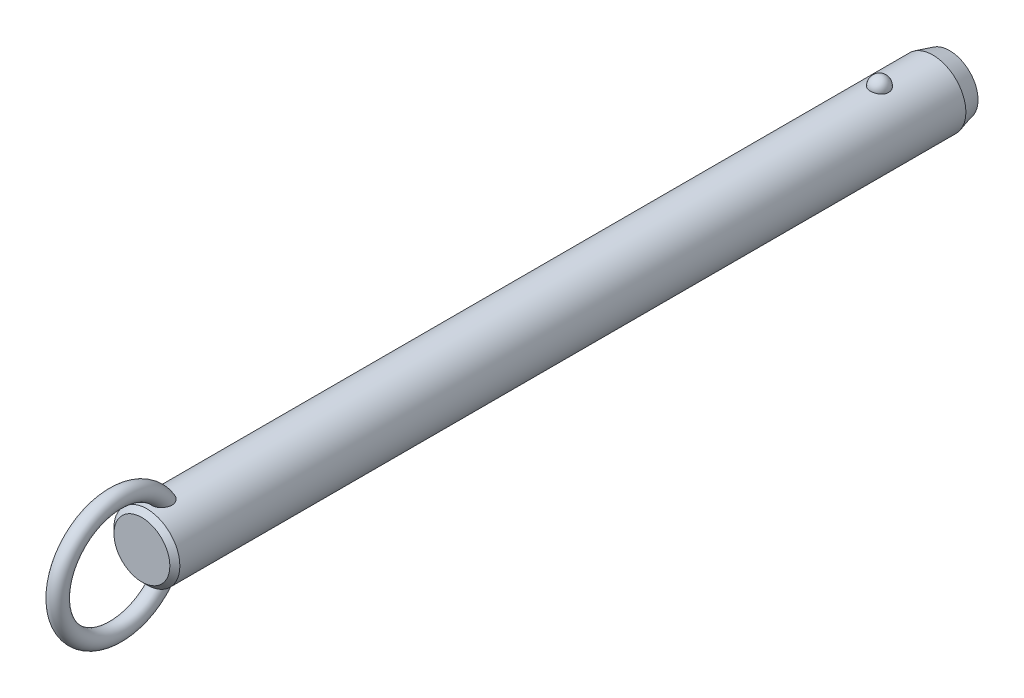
ISO-10303-21;
HEADER;
FILE_DESCRIPTION(('STEP AP214'),'2;1');
FILE_NAME('part.step','',(''),(''),'','','');
FILE_SCHEMA(('AUTOMOTIVE_DESIGN { 1 0 10303 214 1 1 1 1 }'));
ENDSEC;
DATA;
#1=APPLICATION_CONTEXT('core data for automotive mechanical design processes');
#2=APPLICATION_PROTOCOL_DEFINITION('international standard','automotive_design',2000,#1);
#3=PRODUCT_CONTEXT('',#1,'mechanical');
#4=PRODUCT('Part','Part','',(#3));
#5=PRODUCT_RELATED_PRODUCT_CATEGORY('part','',(#4));
#6=PRODUCT_DEFINITION_FORMATION('','',#4);
#7=PRODUCT_DEFINITION_CONTEXT('part definition',#1,'design');
#8=PRODUCT_DEFINITION('design','',#6,#7);
#9=PRODUCT_DEFINITION_SHAPE('','',#8);
#10=(LENGTH_UNIT() NAMED_UNIT(*) SI_UNIT(.MILLI.,.METRE.));
#11=(NAMED_UNIT(*) PLANE_ANGLE_UNIT() SI_UNIT($,.RADIAN.));
#12=(NAMED_UNIT(*) SI_UNIT($,.STERADIAN.) SOLID_ANGLE_UNIT());
#13=UNCERTAINTY_MEASURE_WITH_UNIT(LENGTH_MEASURE(1.E-05),#10,'distance_accuracy_value','');
#14=(GEOMETRIC_REPRESENTATION_CONTEXT(3) GLOBAL_UNCERTAINTY_ASSIGNED_CONTEXT((#13)) GLOBAL_UNIT_ASSIGNED_CONTEXT((#10,
#11,#12)) REPRESENTATION_CONTEXT('',''));
#15=CARTESIAN_POINT('',(0.,0.,0.));
#16=DIRECTION('',(0.,0.,1.));
#17=DIRECTION('',(1.,0.,0.));
#18=AXIS2_PLACEMENT_3D('',#15,#16,#17);
#19=CARTESIAN_POINT('',(0.,0.,165.1));
#20=DIRECTION('',(0.,0.,-1.));
#21=DIRECTION('',(-1.,0.,0.));
#22=AXIS2_PLACEMENT_3D('',#19,#20,#21);
#23=CYLINDRICAL_SURFACE('',#22,7.9);
#24=CARTESIAN_POINT('',(2.1785689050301,7.59367088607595,-2.20000000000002));
#25=CARTESIAN_POINT('',(2.17856679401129,7.59367269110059,-2.07701843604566));
#26=CARTESIAN_POINT('',(2.16853481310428,7.59657145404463,-1.95401006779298));
#27=CARTESIAN_POINT('',(2.12864689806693,7.607843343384,-1.71147811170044));
#28=CARTESIAN_POINT('',(2.09878338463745,7.61621856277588,-1.5919558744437));
#29=CARTESIAN_POINT('',(2.0199931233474,7.63749180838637,-1.35985638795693));
#30=CARTESIAN_POINT('',(1.97107475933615,7.6503878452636,-1.24727610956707));
#31=CARTESIAN_POINT('',(1.85539377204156,7.67926115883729,-1.03213234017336));
#32=CARTESIAN_POINT('',(1.78863158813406,7.69523835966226,-0.929568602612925));
#33=CARTESIAN_POINT('',(1.63856494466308,7.7285848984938,-0.73678633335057));
#34=CARTESIAN_POINT('',(1.55518140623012,7.7459606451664,-0.646630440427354));
#35=CARTESIAN_POINT('',(1.37422937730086,7.78009978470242,-0.481747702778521));
#36=CARTESIAN_POINT('',(1.27666086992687,7.79686317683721,-0.407020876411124));
#37=CARTESIAN_POINT('',(1.07024728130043,7.82786153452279,-0.275278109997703));
#38=CARTESIAN_POINT('',(0.961434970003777,7.84210353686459,-0.218212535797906));
#39=CARTESIAN_POINT('',(0.735351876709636,7.86652194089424,-0.123146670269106));
#40=CARTESIAN_POINT('',(0.618082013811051,7.87669878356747,-0.0851443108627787));
#41=CARTESIAN_POINT('',(0.380637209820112,7.89170521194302,-0.0298158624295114));
#42=CARTESIAN_POINT('',(0.260550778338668,7.89662650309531,-0.0121347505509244));
#43=CARTESIAN_POINT('',(0.0190117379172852,7.90090003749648,0.00324379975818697));
#44=CARTESIAN_POINT('',(-0.102440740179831,7.90025280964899,0.000943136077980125));
#45=CARTESIAN_POINT('',(-0.341452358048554,7.89351056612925,-0.0233955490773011));
#46=CARTESIAN_POINT('',(-0.459042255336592,7.88749257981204,-0.0451545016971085));
#47=CARTESIAN_POINT('',(-0.688796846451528,7.87075812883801,-0.107408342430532));
#48=CARTESIAN_POINT('',(-0.800961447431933,7.86004158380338,-0.14790355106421));
#49=CARTESIAN_POINT('',(-1.01743634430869,7.83497131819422,-0.246799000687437));
#50=CARTESIAN_POINT('',(-1.12169791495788,7.82059709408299,-0.305300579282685));
#51=CARTESIAN_POINT('',(-1.31891765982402,7.78976470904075,-0.43854939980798));
#52=CARTESIAN_POINT('',(-1.41187469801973,7.77330633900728,-0.513298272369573));
#53=CARTESIAN_POINT('',(-1.58577142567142,7.73972434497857,-0.678622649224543));
#54=CARTESIAN_POINT('',(-1.66645140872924,7.72259402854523,-0.769470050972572));
#55=CARTESIAN_POINT('',(-1.81161503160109,7.68983776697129,-0.963538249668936));
#56=CARTESIAN_POINT('',(-1.87609753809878,7.6742119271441,-1.0667599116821));
#57=CARTESIAN_POINT('',(-1.98790138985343,7.6460202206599,-1.28401170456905));
#58=CARTESIAN_POINT('',(-2.03501994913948,7.63349104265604,-1.39815107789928));
#59=CARTESIAN_POINT('',(-2.10986724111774,7.6131449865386,-1.6330178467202));
#60=CARTESIAN_POINT('',(-2.1375965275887,7.60532797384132,-1.75374505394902));
#61=CARTESIAN_POINT('',(-2.17289256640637,7.5953195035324,-1.99782562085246));
#62=CARTESIAN_POINT('',(-2.18054294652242,7.59310471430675,-2.12116592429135));
#63=CARTESIAN_POINT('',(-2.17572919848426,7.59448538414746,-2.36741799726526));
#64=CARTESIAN_POINT('',(-2.1632656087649,7.59808068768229,-2.49032977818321));
#65=CARTESIAN_POINT('',(-2.11865035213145,7.61064035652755,-2.73161015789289));
#66=CARTESIAN_POINT('',(-2.08659579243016,7.61957823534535,-2.84999812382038));
#67=CARTESIAN_POINT('',(-2.00367799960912,7.64179982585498,-3.07955956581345));
#68=CARTESIAN_POINT('',(-1.9528140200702,7.65508371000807,-3.19073275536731));
#69=CARTESIAN_POINT('',(-1.83321113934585,7.68460381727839,-3.40337899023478));
#70=CARTESIAN_POINT('',(-1.76437735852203,7.70085556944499,-3.5047965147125));
#71=CARTESIAN_POINT('',(-1.61069526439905,7.73445734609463,-3.69446912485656));
#72=CARTESIAN_POINT('',(-1.52584634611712,7.75180741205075,-3.78272371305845));
#73=CARTESIAN_POINT('',(-1.34198059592,7.78574608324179,-3.94393987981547));
#74=CARTESIAN_POINT('',(-1.24291308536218,7.80233167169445,-4.01684434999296));
#75=CARTESIAN_POINT('',(-1.03352039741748,7.83281625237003,-4.14489386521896));
#76=CARTESIAN_POINT('',(-0.92319600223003,7.84671543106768,-4.20004014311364));
#77=CARTESIAN_POINT('',(-0.695822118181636,7.87011575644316,-4.29042017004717));
#78=CARTESIAN_POINT('',(-0.578872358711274,7.87966903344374,-4.32589112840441));
#79=CARTESIAN_POINT('',(-0.340410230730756,7.8935652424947,-4.37692226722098));
#80=CARTESIAN_POINT('',(-0.218898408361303,7.89790879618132,-4.39248482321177));
#81=CARTESIAN_POINT('',(0.0228107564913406,7.90087453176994,-4.40314405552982));
#82=CARTESIAN_POINT('',(0.142990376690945,7.89960185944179,-4.39861683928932));
#83=CARTESIAN_POINT('',(0.380829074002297,7.89171262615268,-4.37008293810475));
#84=CARTESIAN_POINT('',(0.498488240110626,7.8850962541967,-4.34607694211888));
#85=CARTESIAN_POINT('',(0.727535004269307,7.86726442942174,-4.27939317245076));
#86=CARTESIAN_POINT('',(0.838944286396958,7.85606616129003,-4.23678512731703));
#87=CARTESIAN_POINT('',(1.05295421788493,7.83025654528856,-4.13408348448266));
#88=CARTESIAN_POINT('',(1.15555431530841,7.81564498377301,-4.07398879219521));
#89=CARTESIAN_POINT('',(1.35076763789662,7.7843022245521,-3.93687432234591));
#90=CARTESIAN_POINT('',(1.4432046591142,7.76754209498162,-3.85961036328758));
#91=CARTESIAN_POINT('',(1.6139111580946,7.73387857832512,-3.69076949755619));
#92=CARTESIAN_POINT('',(1.6921781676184,7.71697516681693,-3.59919010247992));
#93=CARTESIAN_POINT('',(1.83380875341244,7.6845643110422,-3.40247278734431));
#94=CARTESIAN_POINT('',(1.89689280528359,7.66908588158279,-3.29712873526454));
#95=CARTESIAN_POINT('',(2.0047823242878,7.64159441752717,-3.07707931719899));
#96=CARTESIAN_POINT('',(2.0495945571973,7.62958010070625,-2.96237743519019));
#97=CARTESIAN_POINT('',(2.11580183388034,7.61146617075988,-2.74040519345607));
#98=CARTESIAN_POINT('',(2.13929812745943,7.60484503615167,-2.63379846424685));
#99=CARTESIAN_POINT('',(2.17068242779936,7.59594664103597,-2.4181348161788));
#100=CARTESIAN_POINT('',(2.17857077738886,7.59366928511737,-2.30907795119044));
#101=CARTESIAN_POINT('',(2.1785689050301,7.59367088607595,-2.20000000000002));
#102=B_SPLINE_CURVE_WITH_KNOTS('',3,(#24,#25,#26,#27,#28,#29,#30,#31,#32,#33,#34,#35,#36,#37,
#38,#39,#40,#41,#42,#43,#44,#45,#46,#47,#48,#49,#50,#51,#52,#53,#54,#55,#56,#57,#58,#59,#60,#61,
#62,#63,#64,#65,#66,#67,#68,#69,#70,#71,#72,#73,#74,#75,#76,#77,#78,#79,#80,#81,#82,#83,#84,#85,
#86,#87,#88,#89,#90,#91,#92,#93,#94,#95,#96,#97,#98,#99,#100,#101),.UNSPECIFIED.,.T.,.F.,(4,2,2,
2,2,2,2,2,2,2,2,2,2,2,2,2,2,2,2,2,2,2,2,2,2,2,2,2,2,2,2,2,2,2,2,2,2,2,4),(0.,0.368552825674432,
0.737246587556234,1.10577831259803,1.4743009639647,1.8446206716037,2.21494081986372,
2.5842105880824,2.95344028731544,3.31611630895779,3.67875788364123,4.03628044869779,
4.39380913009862,4.75338791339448,5.11300280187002,5.47939989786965,5.8458226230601,
6.21639834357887,6.58696347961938,6.95598276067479,7.32499216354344,7.69218715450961,
8.0593967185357,8.42858578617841,8.79778880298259,9.16834203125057,9.5388695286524,
9.90482699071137,10.2707407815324,10.6298333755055,10.9889132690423,11.3466585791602,
11.7044262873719,12.0676511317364,12.4309391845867,12.8004764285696,13.1698767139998,
13.4967701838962,13.8236564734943),.UNSPECIFIED.);
#103=CARTESIAN_POINT('',(2.1785689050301,7.59367088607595,-2.20000000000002));
#104=VERTEX_POINT('',#103);
#105=EDGE_CURVE('E41',#104,#104,#102,.T.);
#106=ORIENTED_EDGE('',*,*,#105,.T.);
#107=EDGE_LOOP('',(#106));
#108=FACE_BOUND('',#107,.T.);
#109=CARTESIAN_POINT('',(0.,0.,173.42));
#110=DIRECTION('',(0.,0.,1.));
#111=DIRECTION('',(1.,0.,0.));
#112=AXIS2_PLACEMENT_3D('',#109,#110,#111);
#113=CIRCLE('',#112,7.9);
#114=CARTESIAN_POINT('',(7.9,0.,173.42));
#115=VERTEX_POINT('',#114);
#116=EDGE_CURVE('E10',#115,#115,#113,.F.);
#117=ORIENTED_EDGE('',*,*,#116,.T.);
#118=EDGE_LOOP('',(#117));
#119=FACE_BOUND('',#118,.T.);
#120=CARTESIAN_POINT('',(-0.630969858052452,-7.87476203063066,167.312432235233));
#121=CARTESIAN_POINT('',(-0.734180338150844,-7.86648998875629,167.347285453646));
#122=CARTESIAN_POINT('',(-0.834476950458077,-7.85639291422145,167.390816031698));
#123=CARTESIAN_POINT('',(-1.0262035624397,-7.83366343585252,167.494094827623));
#124=CARTESIAN_POINT('',(-1.1176141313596,-7.82102565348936,167.553877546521));
#125=CARTESIAN_POINT('',(-1.28877277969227,-7.79464922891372,167.687839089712));
#126=CARTESIAN_POINT('',(-1.36854014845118,-7.78091246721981,167.761993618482));
#127=CARTESIAN_POINT('',(-1.51461521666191,-7.75380398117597,167.922494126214));
#128=CARTESIAN_POINT('',(-1.58092966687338,-7.74043207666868,168.008833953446));
#129=CARTESIAN_POINT('',(-1.70019064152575,-7.7151252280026,168.192978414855));
#130=CARTESIAN_POINT('',(-1.75284037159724,-7.70322473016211,168.290979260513));
#131=CARTESIAN_POINT('',(-1.84263464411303,-7.68224112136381,168.494102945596));
#132=CARTESIAN_POINT('',(-1.87977299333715,-7.6731591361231,168.599228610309));
#133=CARTESIAN_POINT('',(-1.94152728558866,-7.65777930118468,168.823284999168));
#134=CARTESIAN_POINT('',(-1.96475471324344,-7.65179654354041,168.942616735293));
#135=CARTESIAN_POINT('',(-1.99449499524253,-7.64409642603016,169.18342986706));
#136=CARTESIAN_POINT('',(-2.0010005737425,-7.64238092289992,169.304912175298));
#137=CARTESIAN_POINT('',(-1.99856014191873,-7.64302120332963,169.568340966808));
#138=CARTESIAN_POINT('',(-1.98680021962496,-7.64611845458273,169.71025654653));
#139=CARTESIAN_POINT('',(-1.94457772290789,-7.65696186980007,169.991118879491));
#140=CARTESIAN_POINT('',(-1.91409393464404,-7.66471330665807,170.130062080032));
#141=CARTESIAN_POINT('',(-1.82768670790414,-7.68582947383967,170.431939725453));
#142=CARTESIAN_POINT('',(-1.76772963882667,-7.70003779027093,170.593686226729));
#143=CARTESIAN_POINT('',(-1.65998501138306,-7.72371550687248,170.827695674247));
#144=CARTESIAN_POINT('',(-1.62107967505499,-7.73200670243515,170.904297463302));
#145=CARTESIAN_POINT('',(-1.53727726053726,-7.74910377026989,171.054079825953));
#146=CARTESIAN_POINT('',(-1.49238215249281,-7.75790947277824,171.127261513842));
#147=CARTESIAN_POINT('',(-1.37397050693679,-7.77993338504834,171.30288382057));
#148=CARTESIAN_POINT('',(-1.29690364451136,-7.79328473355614,171.402955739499));
#149=CARTESIAN_POINT('',(-1.1288548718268,-7.81939266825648,171.590714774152));
#150=CARTESIAN_POINT('',(-1.0378992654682,-7.83215032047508,171.678424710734));
#151=CARTESIAN_POINT('',(-0.86953281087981,-7.85231710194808,171.813414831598));
#152=CARTESIAN_POINT('',(-0.795716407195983,-7.86021093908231,171.865076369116));
#153=CARTESIAN_POINT('',(-0.640813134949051,-7.87434920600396,171.956381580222));
#154=CARTESIAN_POINT('',(-0.559737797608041,-7.88059619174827,171.99604389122));
#155=CARTESIAN_POINT('',(-0.406456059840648,-7.88984116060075,172.054300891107));
#156=CARTESIAN_POINT('',(-0.335227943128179,-7.89321892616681,172.075384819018));
#157=CARTESIAN_POINT('',(-0.190193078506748,-7.89804235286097,172.10541418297));
#158=CARTESIAN_POINT('',(-0.11638863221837,-7.89948969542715,172.114370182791));
#159=CARTESIAN_POINT('',(0.0318414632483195,-7.90028409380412,172.119291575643));
#160=CARTESIAN_POINT('',(0.106268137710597,-7.89962640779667,172.115227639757));
#161=CARTESIAN_POINT('',(0.253290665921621,-7.8962818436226,172.094461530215));
#162=CARTESIAN_POINT('',(0.325885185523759,-7.8935935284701,172.077750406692));
#163=CARTESIAN_POINT('',(0.481441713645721,-7.88577340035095,172.028738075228));
#164=CARTESIAN_POINT('',(0.563611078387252,-7.88026321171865,171.994005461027));
#165=CARTESIAN_POINT('',(0.721129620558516,-7.86741729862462,171.911796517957));
#166=CARTESIAN_POINT('',(0.79646633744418,-7.86007832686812,171.864297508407));
#167=CARTESIAN_POINT('',(0.971456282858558,-7.84073285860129,171.736513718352));
#168=CARTESIAN_POINT('',(1.06719686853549,-7.82809461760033,171.651004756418));
#169=CARTESIAN_POINT('',(1.24418921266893,-7.80192439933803,171.466232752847));
#170=CARTESIAN_POINT('',(1.32540832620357,-7.78839049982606,171.366939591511));
#171=CARTESIAN_POINT('',(1.45199971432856,-7.76559693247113,171.189576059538));
#172=CARTESIAN_POINT('',(1.50085649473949,-7.75626094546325,171.113954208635));
#173=CARTESIAN_POINT('',(1.59197749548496,-7.7380727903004,170.958742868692));
#174=CARTESIAN_POINT('',(1.63423919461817,-7.72922080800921,170.879151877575));
#175=CARTESIAN_POINT('',(1.71222612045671,-7.71231959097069,170.716664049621));
#176=CARTESIAN_POINT('',(1.74794516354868,-7.70427111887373,170.633764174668));
#177=CARTESIAN_POINT('',(1.81270113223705,-7.68929240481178,170.465296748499));
#178=CARTESIAN_POINT('',(1.84173789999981,-7.68236218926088,170.379729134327));
#179=CARTESIAN_POINT('',(1.89322698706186,-7.6698375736,170.20528702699));
#180=CARTESIAN_POINT('',(1.91558744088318,-7.66426199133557,170.116383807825));
#181=CARTESIAN_POINT('',(1.95281367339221,-7.65485915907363,169.936969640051));
#182=CARTESIAN_POINT('',(1.96767946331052,-7.65103190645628,169.846458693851));
#183=CARTESIAN_POINT('',(2.00021456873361,-7.64262981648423,169.573732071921));
#184=CARTESIAN_POINT('',(2.00600691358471,-7.6410871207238,169.389709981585));
#185=CARTESIAN_POINT('',(1.98445334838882,-7.64669564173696,169.076501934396));
#186=CARTESIAN_POINT('',(1.96607186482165,-7.65149688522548,168.946618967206));
#187=CARTESIAN_POINT('',(1.90884967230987,-7.6659762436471,168.691632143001));
#188=CARTESIAN_POINT('',(1.87002101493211,-7.67565148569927,168.566525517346));
#189=CARTESIAN_POINT('',(1.77063986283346,-7.69918471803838,168.32454013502));
#190=CARTESIAN_POINT('',(1.70993724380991,-7.71307150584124,168.207725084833));
#191=CARTESIAN_POINT('',(1.56733070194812,-7.74330306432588,167.988144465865));
#192=CARTESIAN_POINT('',(1.48543692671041,-7.75964665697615,167.885372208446));
#193=CARTESIAN_POINT('',(1.31346177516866,-7.79047523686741,167.709380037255));
#194=CARTESIAN_POINT('',(1.22547278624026,-7.80495298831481,167.634106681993));
#195=CARTESIAN_POINT('',(1.0372435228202,-7.83218597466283,167.500486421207));
#196=CARTESIAN_POINT('',(0.937008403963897,-7.84494192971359,167.442132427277));
#197=CARTESIAN_POINT('',(0.73359933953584,-7.86649045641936,167.347027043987));
#198=CARTESIAN_POINT('',(0.630941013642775,-7.87547134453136,167.309210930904));
#199=CARTESIAN_POINT('',(0.420465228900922,-7.88950708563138,167.251116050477));
#200=CARTESIAN_POINT('',(0.312645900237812,-7.89456050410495,167.23084369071));
#201=CARTESIAN_POINT('',(0.0960869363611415,-7.9001518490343,167.208455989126));
#202=CARTESIAN_POINT('',(-0.012634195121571,-7.90073226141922,167.206169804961));
#203=CARTESIAN_POINT('',(-0.228766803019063,-7.89742350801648,167.219367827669));
#204=CARTESIAN_POINT('',(-0.336180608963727,-7.89354403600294,167.234813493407));
#205=CARTESIAN_POINT('',(-0.473410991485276,-7.88586871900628,167.266217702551));
#206=CARTESIAN_POINT('',(-0.505257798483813,-7.88388984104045,167.274354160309));
#207=CARTESIAN_POINT('',(-0.568481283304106,-7.87958326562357,167.292208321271));
#208=CARTESIAN_POINT('',(-0.599857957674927,-7.87725556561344,167.301926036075));
#209=CARTESIAN_POINT('',(-0.630969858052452,-7.87476203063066,167.312432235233));
#210=B_SPLINE_CURVE_WITH_KNOTS('',3,(#120,#121,#122,#123,#124,#125,#126,#127,#128,#129,#130,
#131,#132,#133,#134,#135,#136,#137,#138,#139,#140,#141,#142,#143,#144,#145,#146,#147,#148,#149,
#150,#151,#152,#153,#154,#155,#156,#157,#158,#159,#160,#161,#162,#163,#164,#165,#166,#167,#168,
#169,#170,#171,#172,#173,#174,#175,#176,#177,#178,#179,#180,#181,#182,#183,#184,#185,#186,#187,
#188,#189,#190,#191,#192,#193,#194,#195,#196,#197,#198,#199,#200,#201,#202,#203,#204,#205,#206,
#207,#208,#209),.UNSPECIFIED.,.T.,.F.,(4,2,2,2,2,2,2,2,2,2,2,2,2,2,2,2,2,2,2,2,2,2,2,2,2,2,2,2,
2,2,2,2,2,2,2,2,2,2,2,2,2,2,2,2,4),(0.,0.327622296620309,0.655945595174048,0.983718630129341,
1.3113267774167,1.64554655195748,1.97989964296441,2.34365728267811,2.70757317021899,
3.13333684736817,3.55958380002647,4.07655306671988,4.33527897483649,4.59391999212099,
4.97382437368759,5.353017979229,5.62348245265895,5.89352465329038,6.11565959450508,
6.33760092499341,6.56004255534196,6.78264174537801,7.04930844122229,7.31645206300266,
7.70130871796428,8.08701995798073,8.35824509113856,8.62957365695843,8.90115735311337,
9.1727474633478,9.44791855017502,9.72308922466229,10.2715298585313,10.6638393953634,
11.0559179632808,11.4507403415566,11.8453740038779,12.1936425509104,12.5417649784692,
12.8695063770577,13.1973674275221,13.5221104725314,13.8461490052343,13.9449071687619,
14.0436660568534),.UNSPECIFIED.);
#211=CARTESIAN_POINT('',(-0.630969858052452,-7.87476203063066,167.312432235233));
#212=VERTEX_POINT('',#211);
#213=EDGE_CURVE('E59',#212,#212,#210,.T.);
#214=ORIENTED_EDGE('',*,*,#213,.T.);
#215=EDGE_LOOP('',(#214));
#216=FACE_BOUND('',#215,.T.);
#217=CARTESIAN_POINT('',(-0.630969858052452,7.87476203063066,167.312432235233));
#218=CARTESIAN_POINT('',(-0.52891882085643,7.88293636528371,167.277979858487));
#219=CARTESIAN_POINT('',(-0.423745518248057,7.88934810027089,167.251915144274));
#220=CARTESIAN_POINT('',(-0.210236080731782,7.8979273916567,167.217282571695));
#221=CARTESIAN_POINT('',(-0.101893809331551,7.90008607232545,167.208751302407));
#222=CARTESIAN_POINT('',(0.11466056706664,7.89990877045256,167.209457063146));
#223=CARTESIAN_POINT('',(0.222872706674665,7.89757640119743,167.21867980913));
#224=CARTESIAN_POINT('',(0.436107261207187,7.88867538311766,167.254652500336));
#225=CARTESIAN_POINT('',(0.541131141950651,7.8821087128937,167.28139425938));
#226=CARTESIAN_POINT('',(0.745085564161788,7.86545130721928,167.351756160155));
#227=CARTESIAN_POINT('',(0.844015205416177,7.85536005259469,167.395378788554));
#228=CARTESIAN_POINT('',(1.03299167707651,7.83275153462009,167.498379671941));
#229=CARTESIAN_POINT('',(1.12303841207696,7.8202342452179,167.557758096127));
#230=CARTESIAN_POINT('',(1.29214734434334,7.79408219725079,167.690864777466));
#231=CARTESIAN_POINT('',(1.37116907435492,7.78044359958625,167.764643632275));
#232=CARTESIAN_POINT('',(1.51597677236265,7.75353170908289,167.924235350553));
#233=CARTESIAN_POINT('',(1.58176261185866,7.74025841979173,168.010048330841));
#234=CARTESIAN_POINT('',(1.70057386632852,7.71504069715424,168.193644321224));
#235=CARTESIAN_POINT('',(1.75320073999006,7.7031425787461,168.291690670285));
#236=CARTESIAN_POINT('',(1.8429376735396,7.68216822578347,168.494893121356));
#237=CARTESIAN_POINT('',(1.88004278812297,7.67309289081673,168.600051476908));
#238=CARTESIAN_POINT('',(1.9417232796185,7.6577294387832,168.824167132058));
#239=CARTESIAN_POINT('',(1.96491037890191,7.65175648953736,168.943524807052));
#240=CARTESIAN_POINT('',(1.9945689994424,7.64407702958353,169.184384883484));
#241=CARTESIAN_POINT('',(2.00103304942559,7.64237242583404,169.30588821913));
#242=CARTESIAN_POINT('',(1.99850166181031,7.64303650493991,169.569368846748));
#243=CARTESIAN_POINT('',(1.98669038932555,7.64614714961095,169.711314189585));
#244=CARTESIAN_POINT('',(1.94436120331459,7.6570170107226,169.992228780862));
#245=CARTESIAN_POINT('',(1.91382203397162,7.66478150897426,170.131194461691));
#246=CARTESIAN_POINT('',(1.82728754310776,7.68592483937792,170.433111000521));
#247=CARTESIAN_POINT('',(1.76725778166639,7.7001468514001,170.594872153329));
#248=CARTESIAN_POINT('',(1.65939700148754,7.72384204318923,170.828891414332));
#249=CARTESIAN_POINT('',(1.62045187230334,7.73213852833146,170.905494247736));
#250=CARTESIAN_POINT('',(1.53656684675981,7.74924489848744,171.055273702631));
#251=CARTESIAN_POINT('',(1.49162892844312,7.75805461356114,171.128451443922));
#252=CARTESIAN_POINT('',(1.37317698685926,7.78007342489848,171.303952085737));
#253=CARTESIAN_POINT('',(1.29612360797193,7.79341423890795,171.403911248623));
#254=CARTESIAN_POINT('',(1.12812043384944,7.81949839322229,171.59145083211));
#255=CARTESIAN_POINT('',(1.03719688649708,7.83224280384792,171.679054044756));
#256=CARTESIAN_POINT('',(0.868871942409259,7.85239026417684,171.81389715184));
#257=CARTESIAN_POINT('',(0.795056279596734,7.86027769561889,171.865511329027));
#258=CARTESIAN_POINT('',(0.640160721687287,7.87440222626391,171.956720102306));
#259=CARTESIAN_POINT('',(0.559092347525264,7.88064188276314,171.996333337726));
#260=CARTESIAN_POINT('',(0.405820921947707,7.8898738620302,172.054505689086));
#261=CARTESIAN_POINT('',(0.334594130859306,7.89324577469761,172.075552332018));
#262=CARTESIAN_POINT('',(0.189568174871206,7.89805733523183,172.105507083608));
#263=CARTESIAN_POINT('',(0.115771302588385,7.89949866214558,172.114425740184));
#264=CARTESIAN_POINT('',(-0.0324359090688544,7.90028156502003,172.11927589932));
#265=CARTESIAN_POINT('',(-0.106847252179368,7.89961843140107,172.115178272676));
#266=CARTESIAN_POINT('',(-0.253834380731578,7.8962642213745,172.094351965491));
#267=CARTESIAN_POINT('',(-0.326408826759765,7.89357170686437,172.077614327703));
#268=CARTESIAN_POINT('',(-0.481962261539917,7.88574179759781,172.028539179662));
#269=CARTESIAN_POINT('',(-0.564145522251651,7.88022507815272,171.993763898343));
#270=CARTESIAN_POINT('',(-0.7216852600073,7.86736646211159,171.911468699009));
#271=CARTESIAN_POINT('',(-0.797029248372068,7.8600213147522,171.863926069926));
#272=CARTESIAN_POINT('',(-0.972044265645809,7.84066026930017,171.736026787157));
#273=CARTESIAN_POINT('',(-1.0677980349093,7.828012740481,171.650443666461));
#274=CARTESIAN_POINT('',(-1.24480531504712,7.80182621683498,171.465522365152));
#275=CARTESIAN_POINT('',(-1.32602618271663,7.78828530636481,171.366154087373));
#276=CARTESIAN_POINT('',(-1.4525983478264,7.76548487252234,171.188680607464));
#277=CARTESIAN_POINT('',(-1.50143856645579,7.75614818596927,171.113025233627));
#278=CARTESIAN_POINT('',(-1.59252410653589,7.73796020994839,170.957748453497));
#279=CARTESIAN_POINT('',(-1.63476690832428,7.729109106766,170.878125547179));
#280=CARTESIAN_POINT('',(-1.7127131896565,7.71221133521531,170.715575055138));
#281=CARTESIAN_POINT('',(-1.74841047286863,7.70416543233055,170.632644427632));
#282=CARTESIAN_POINT('',(-1.81311929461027,7.6891937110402,170.464116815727));
#283=CARTESIAN_POINT('',(-1.84213067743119,7.68226791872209,170.378519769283));
#284=CARTESIAN_POINT('',(-1.89356259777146,7.66975461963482,170.204025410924));
#285=CARTESIAN_POINT('',(-1.91589165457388,7.66418586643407,170.115099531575));
#286=CARTESIAN_POINT('',(-1.9530507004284,7.65479859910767,169.935642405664));
#287=CARTESIAN_POINT('',(-1.96788069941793,7.65098008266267,169.845111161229));
#288=CARTESIAN_POINT('',(-2.00030078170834,7.64260704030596,169.572327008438));
#289=CARTESIAN_POINT('',(-2.00600576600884,7.64108760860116,169.388271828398));
#290=CARTESIAN_POINT('',(-1.9842848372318,7.64673945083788,169.075080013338));
#291=CARTESIAN_POINT('',(-1.96583698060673,7.65155751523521,168.945240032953));
#292=CARTESIAN_POINT('',(-1.90848948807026,7.66606613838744,168.690361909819));
#293=CARTESIAN_POINT('',(-1.86960376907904,7.67575338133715,168.565320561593));
#294=CARTESIAN_POINT('',(-1.77013421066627,7.6993013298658,168.323500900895));
#295=CARTESIAN_POINT('',(-1.70940488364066,7.71318991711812,168.206784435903));
#296=CARTESIAN_POINT('',(-1.5667295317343,7.74342495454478,167.987340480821));
#297=CARTESIAN_POINT('',(-1.48478316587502,7.75977144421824,167.88461321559));
#298=CARTESIAN_POINT('',(-1.31266325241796,7.79061163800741,167.708643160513));
#299=CARTESIAN_POINT('',(-1.22456383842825,7.80509908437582,167.633358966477));
#300=CARTESIAN_POINT('',(-1.03622400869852,7.83231881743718,167.499865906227));
#301=CARTESIAN_POINT('',(-0.93601531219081,7.84505551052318,167.441613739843));
#302=CARTESIAN_POINT('',(-0.798824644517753,7.85957802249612,167.377540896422));
#303=CARTESIAN_POINT('',(-0.765787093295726,7.86286821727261,167.363224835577));
#304=CARTESIAN_POINT('',(-0.698939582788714,7.86909211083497,167.336436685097));
#305=CARTESIAN_POINT('',(-0.665129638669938,7.8720258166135,167.323964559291));
#306=CARTESIAN_POINT('',(-0.630969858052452,7.87476203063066,167.312432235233));
#307=B_SPLINE_CURVE_WITH_KNOTS('',3,(#217,#218,#219,#220,#221,#222,#223,#224,#225,#226,#227,
#228,#229,#230,#231,#232,#233,#234,#235,#236,#237,#238,#239,#240,#241,#242,#243,#244,#245,#246,
#247,#248,#249,#250,#251,#252,#253,#254,#255,#256,#257,#258,#259,#260,#261,#262,#263,#264,#265,
#266,#267,#268,#269,#270,#271,#272,#273,#274,#275,#276,#277,#278,#279,#280,#281,#282,#283,#284,
#285,#286,#287,#288,#289,#290,#291,#292,#293,#294,#295,#296,#297,#298,#299,#300,#301,#302,#303,
#304,#305,#306),.UNSPECIFIED.,.T.,.F.,(4,2,2,2,2,2,2,2,2,2,2,2,2,2,2,2,2,2,2,2,2,2,2,2,2,2,2,2,
2,2,2,2,2,2,2,2,2,2,2,2,2,2,2,2,4),(0.,0.32392037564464,0.648516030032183,0.972850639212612,
1.29703380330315,1.62126473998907,1.94549915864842,2.27089401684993,2.5962920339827,
2.93059633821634,3.26500707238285,3.6288164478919,3.99278833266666,4.41865421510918,
4.84500434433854,5.36209210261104,5.62087589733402,5.87957448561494,6.25918598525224,
6.63808782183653,6.90846748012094,7.17842501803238,7.40052350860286,7.6224287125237,
7.84483086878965,8.0673907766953,8.33414615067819,8.60137921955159,8.98641454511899,
9.37230415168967,9.64358673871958,9.91497268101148,10.1866142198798,10.4582620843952,
10.7334745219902,11.0086865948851,11.5572126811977,11.9494246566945,12.3413699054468,
12.7359755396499,13.1305875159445,13.4791770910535,13.82687259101,13.9353013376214,
14.0437279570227),.UNSPECIFIED.);
#308=CARTESIAN_POINT('',(-0.630969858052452,7.87476203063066,167.312432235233));
#309=VERTEX_POINT('',#308);
#310=EDGE_CURVE('E67',#309,#309,#307,.T.);
#311=ORIENTED_EDGE('',*,*,#310,.T.);
#312=EDGE_LOOP('',(#311));
#313=FACE_BOUND('',#312,.T.);
#314=CARTESIAN_POINT('',(0.,0.,-15.));
#315=DIRECTION('',(0.,0.,-1.));
#316=DIRECTION('',(-1.,0.,0.));
#317=AXIS2_PLACEMENT_3D('',#314,#315,#316);
#318=CIRCLE('',#317,7.9);
#319=CARTESIAN_POINT('',(-7.9,0.,-15.));
#320=VERTEX_POINT('',#319);
#321=EDGE_CURVE('E56',#320,#320,#318,.F.);
#322=ORIENTED_EDGE('',*,*,#321,.T.);
#323=EDGE_LOOP('',(#322));
#324=FACE_BOUND('',#323,.T.);
#325=ADVANCED_FACE('F37',(#108,#119,#216,#313,#324),#23,.T.);
#326=CARTESIAN_POINT('',(0.,0.,-19.));
#327=DIRECTION('',(0.,0.,-1.));
#328=DIRECTION('',(-1.,0.,0.));
#329=AXIS2_PLACEMENT_3D('',#326,#327,#328);
#330=PLANE('',#329);
#331=CARTESIAN_POINT('',(0.,0.,-19.));
#332=DIRECTION('',(0.,0.,-1.));
#333=DIRECTION('',(-1.,0.,0.));
#334=AXIS2_PLACEMENT_3D('',#331,#332,#333);
#335=CIRCLE('',#334,6.82820323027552);
#336=CARTESIAN_POINT('',(-6.82820323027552,0.,-19.));
#337=VERTEX_POINT('',#336);
#338=EDGE_CURVE('E66',#337,#337,#335,.T.);
#339=ORIENTED_EDGE('',*,*,#338,.T.);
#340=EDGE_LOOP('',(#339));
#341=FACE_BOUND('',#340,.T.);
#342=ADVANCED_FACE('F85',(#341),#330,.T.);
#343=CARTESIAN_POINT('',(0.,0.,-19.));
#344=DIRECTION('',(0.,0.,1.));
#345=DIRECTION('',(1.,0.,0.));
#346=AXIS2_PLACEMENT_3D('',#343,#344,#345);
#347=CONICAL_SURFACE('',#346,6.82820323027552,0.261799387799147);
#348=ORIENTED_EDGE('',*,*,#321,.F.);
#349=EDGE_LOOP('',(#348));
#350=FACE_BOUND('',#349,.T.);
#351=ORIENTED_EDGE('',*,*,#338,.F.);
#352=EDGE_LOOP('',(#351));
#353=FACE_BOUND('',#352,.T.);
#354=ADVANCED_FACE('F83',(#350,#353),#347,.T.);
#355=CARTESIAN_POINT('',(0.,0.,174.62));
#356=DIRECTION('',(0.,0.,1.));
#357=DIRECTION('',(1.,0.,0.));
#358=AXIS2_PLACEMENT_3D('',#355,#356,#357);
#359=PLANE('',#358);
#360=CARTESIAN_POINT('',(0.,0.,174.62));
#361=DIRECTION('',(0.,0.,1.));
#362=DIRECTION('',(1.,0.,0.));
#363=AXIS2_PLACEMENT_3D('',#360,#361,#362);
#364=CIRCLE('',#363,6.69999999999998);
#365=CARTESIAN_POINT('',(6.69999999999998,0.,174.62));
#366=VERTEX_POINT('',#365);
#367=EDGE_CURVE('E50',#366,#366,#364,.T.);
#368=ORIENTED_EDGE('',*,*,#367,.T.);
#369=EDGE_LOOP('',(#368));
#370=FACE_BOUND('',#369,.T.);
#371=ADVANCED_FACE('F77',(#370),#359,.T.);
#372=CARTESIAN_POINT('',(0.,0.,180.95));
#373=DIRECTION('',(1.,0.,0.));
#374=DIRECTION('',(0.,0.,-1.));
#375=AXIS2_PLACEMENT_3D('',#372,#373,#374);
#376=TOROIDAL_SURFACE('',#375,13.85,2.);
#377=ORIENTED_EDGE('',*,*,#310,.F.);
#378=EDGE_LOOP('',(#377));
#379=FACE_BOUND('',#378,.T.);
#380=ORIENTED_EDGE('',*,*,#213,.F.);
#381=EDGE_LOOP('',(#380));
#382=FACE_BOUND('',#381,.T.);
#383=ADVANCED_FACE('F73',(#379,#382),#376,.T.);
#384=CARTESIAN_POINT('',(0.,0.,174.62));
#385=DIRECTION('',(0.,0.,-1.));
#386=DIRECTION('',(-1.,0.,0.));
#387=AXIS2_PLACEMENT_3D('',#384,#385,#386);
#388=CONICAL_SURFACE('',#387,6.69999999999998,0.785398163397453);
#389=ORIENTED_EDGE('',*,*,#116,.F.);
#390=EDGE_LOOP('',(#389));
#391=FACE_BOUND('',#390,.T.);
#392=ORIENTED_EDGE('',*,*,#367,.F.);
#393=EDGE_LOOP('',(#392));
#394=FACE_BOUND('',#393,.T.);
#395=ADVANCED_FACE('F39',(#391,#394),#388,.T.);
#396=CARTESIAN_POINT('',(0.,7.9,-2.20000000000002));
#397=DIRECTION('',(0.,1.,0.));
#398=DIRECTION('',(0.,0.,-1.));
#399=AXIS2_PLACEMENT_3D('',#396,#397,#398);
#400=SPHERICAL_SURFACE('',#399,2.2);
#401=ORIENTED_EDGE('',*,*,#105,.F.);
#402=EDGE_LOOP('',(#401));
#403=FACE_BOUND('',#402,.T.);
#404=ADVANCED_FACE('F79',(#403),#400,.T.);
#405=CLOSED_SHELL('',(#325,#342,#354,#371,#383,#395,#404));
#406=MANIFOLD_SOLID_BREP('B2',#405);
#407=ADVANCED_BREP_SHAPE_REPRESENTATION('',(#18,#406),#14);
#408=SHAPE_DEFINITION_REPRESENTATION(#9,#407);
ENDSEC;
END-ISO-10303-21;
